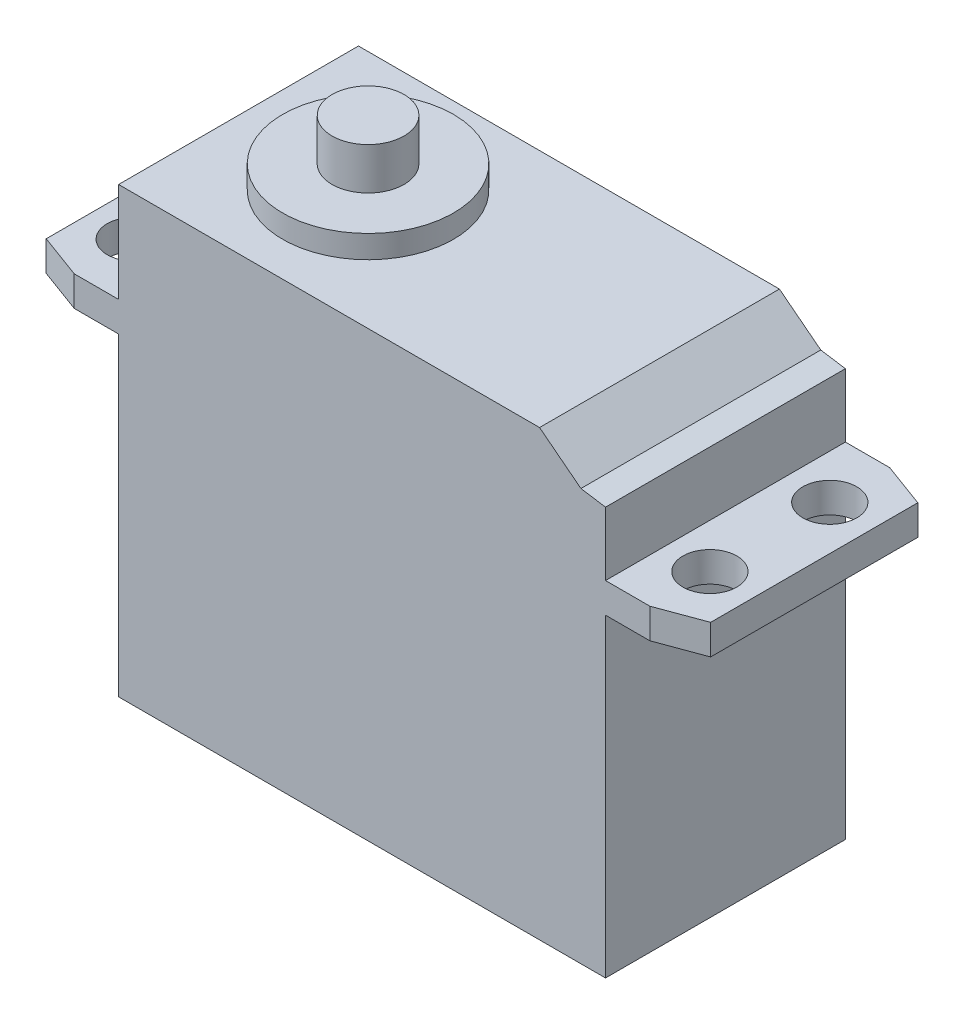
from build123d import *

# Parameters (mm, degrees)
SKETCH1_W                     = 40.6
SKETCH1_H                     = 20
BODY_MAIN_EXTRUDE_DEPTH       = 37
SKETCH2_W                     = 20
SKETCH2_H                     = 2.5
MOUNT_TAB_EXTRUDE_DEPTH       = 7.4
MOUNTING_HOLES_REACH          = 61.394
SKETCH3_R                     = 2.25
SKETCH4_R                     = 7.125
SURROUNDING_SPLINE_BOSS_DEPTH = 1.9
SKETCH5_R                     = 3
SPLINE_DEPTH                  = 3.5
ORNAMENTALCUT_REACH           = 69.095
SKETCH8_W                     = 6.75
SKETCH8_H                     = 3.7
BOSS_EXTRUDE6_DEPTH           = 2


with BuildPart() as part:
    # Sketch1 → Body Main Extrude (new body)
    with BuildSketch(Plane(origin=(0, 0, 0), x_dir=(1, 0, 0), z_dir=(0, 1, 0))):
        with Locations((20.3, 10)):
            Rectangle(SKETCH1_W, SKETCH1_H)
    extrude(amount=BODY_MAIN_EXTRUDE_DEPTH)

    # Sketch2 → Mount Tab Extrude (add)
    with BuildSketch(Plane(origin=(40.6, 0, 0), x_dir=(0, 0, -1), z_dir=(1, 0, 0))):
        with Locations((10, 27.45)):
            Rectangle(SKETCH2_W, SKETCH2_H)
    mount_tab_extrude = extrude(amount=MOUNT_TAB_EXTRUDE_DEPTH)

    # Sketch3 → Mounting Holes (cut, up to next)
    with BuildSketch(Plane(origin=(0, 28.7, 0), x_dir=(1, 0, 0), z_dir=(0, 1, 0)), mode=Mode.PRIVATE) as mounting_holes_sk1:
        with Locations(Location((44.3, 15, 0), (0, 0, 270))):
            Circle(SKETCH3_R)
    mounting_holes_tool1 = extrude(mounting_holes_sk1.sketch, amount=-MOUNTING_HOLES_REACH, mode=Mode.PRIVATE) & part.part
    # Sketch3 → Mounting Holes (cut, up to next)
    with BuildSketch(Plane(origin=(0, 28.7, 0), x_dir=(1, 0, 0), z_dir=(0, 1, 0)), mode=Mode.PRIVATE) as mounting_holes_sk2:
        with Locations(Location((44.3, 5, 0), (0, 0, 270))):
            Circle(SKETCH3_R)
    mounting_holes_tool2 = extrude(mounting_holes_sk2.sketch, amount=-MOUNTING_HOLES_REACH, mode=Mode.PRIVATE) & part.part
    # Sketch3 → Mounting Holes (cut, up to next)
    with BuildSketch(Plane(origin=(0, 28.7, 0), x_dir=(1, 0, 0), z_dir=(0, 1, 0)), mode=Mode.PRIVATE) as mounting_holes_sk3:
        Polygon((44.3, 20), (48, 18.63570323), (48, 20), align=None)
    mounting_holes_tool3 = extrude(mounting_holes_sk3.sketch, amount=-MOUNTING_HOLES_REACH, mode=Mode.PRIVATE) & part.part
    # Sketch3 → Mounting Holes (cut, up to next)
    with BuildSketch(Plane(origin=(0, 28.7, 0), x_dir=(1, 0, 0), z_dir=(0, 1, 0)), mode=Mode.PRIVATE) as mounting_holes_sk4:
        Polygon((48, 0), (48, 1.36429677), (44.3, 0), align=None)
    mounting_holes_tool4 = extrude(mounting_holes_sk4.sketch, amount=-MOUNTING_HOLES_REACH, mode=Mode.PRIVATE) & part.part
    mounting_holes_1 = mounting_holes_tool1.solids().sort_by_distance((44.3, 28.7, -15))[0]
    add(mounting_holes_1, mode=Mode.SUBTRACT)
    mounting_holes_2 = mounting_holes_tool2.solids().sort_by_distance((44.3, 28.7, -5))[0]
    add(mounting_holes_2, mode=Mode.SUBTRACT)
    mounting_holes_3 = mounting_holes_tool3.solids().sort_by_distance((46.766667, 28.7, -19.545234))[0]
    add(mounting_holes_3, mode=Mode.SUBTRACT)
    mounting_holes_4 = mounting_holes_tool4.solids().sort_by_distance((46.766667, 28.7, -0.454766))[0]
    add(mounting_holes_4, mode=Mode.SUBTRACT)
    mounting_holes = mounting_holes_1 + mounting_holes_2 + mounting_holes_3 + mounting_holes_4  # Mounting Holes as one shape, for the pattern or mirror that repeats it

    # Mount Tab Mirror: Mount Tab Extrude, Mounting Holes across plane
    add(mount_tab_extrude.mirror(Plane(origin=(20.3, 0, 0), x_dir=(0, 0, 1), z_dir=(1, 0, 0))))
    add(mounting_holes.mirror(Plane(origin=(20.3, 0, 0), x_dir=(0, 0, 1), z_dir=(1, 0, 0))), mode=Mode.SUBTRACT)

    # Sketch4 → Surrounding Spline Boss (add)
    with BuildSketch(Plane(origin=(0, 37, 0), x_dir=(1, 0, 0), z_dir=(0, 1, 0))):
        with Locations(Location((10.8, 10, 0), (0, 0, 90))):
            Circle(SKETCH4_R)
    extrude(amount=SURROUNDING_SPLINE_BOSS_DEPTH)

    # Sketch5 → Spline (add)
    with BuildSketch(Plane(origin=(0, 38.9, 0), x_dir=(1, 0, 0), z_dir=(0, 1, 0))):
        with Locations(Location((10.8, 10, 0), (0, 0, 270))):
            Circle(SKETCH5_R)
    extrude(amount=SPLINE_DEPTH)

    # Sketch7 → OrnamentalCut (cut, up to next)
    with BuildSketch(Plane.XY, mode=Mode.PRIVATE) as ornamentalcut_sk1:
        Polygon((35.1, 37), (40.6, 37), (40.6, 34), (38.547749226, 34.321888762), align=None)
    ornamentalcut_tool1 = extrude(ornamentalcut_sk1.sketch, amount=-ORNAMENTALCUT_REACH, mode=Mode.PRIVATE) & part.part
    add(ornamentalcut_tool1.solids().sort_by_distance((38.623002, 35.812522, 0))[0], mode=Mode.SUBTRACT)

    # Sketch8 → Boss-Extrude6 (add)
    with BuildSketch(Plane.ZY):
        with Locations((-10, 1.85)):
            Rectangle(SKETCH8_W, SKETCH8_H)
    extrude(amount=BOSS_EXTRUDE6_DEPTH)


solid = part.part
